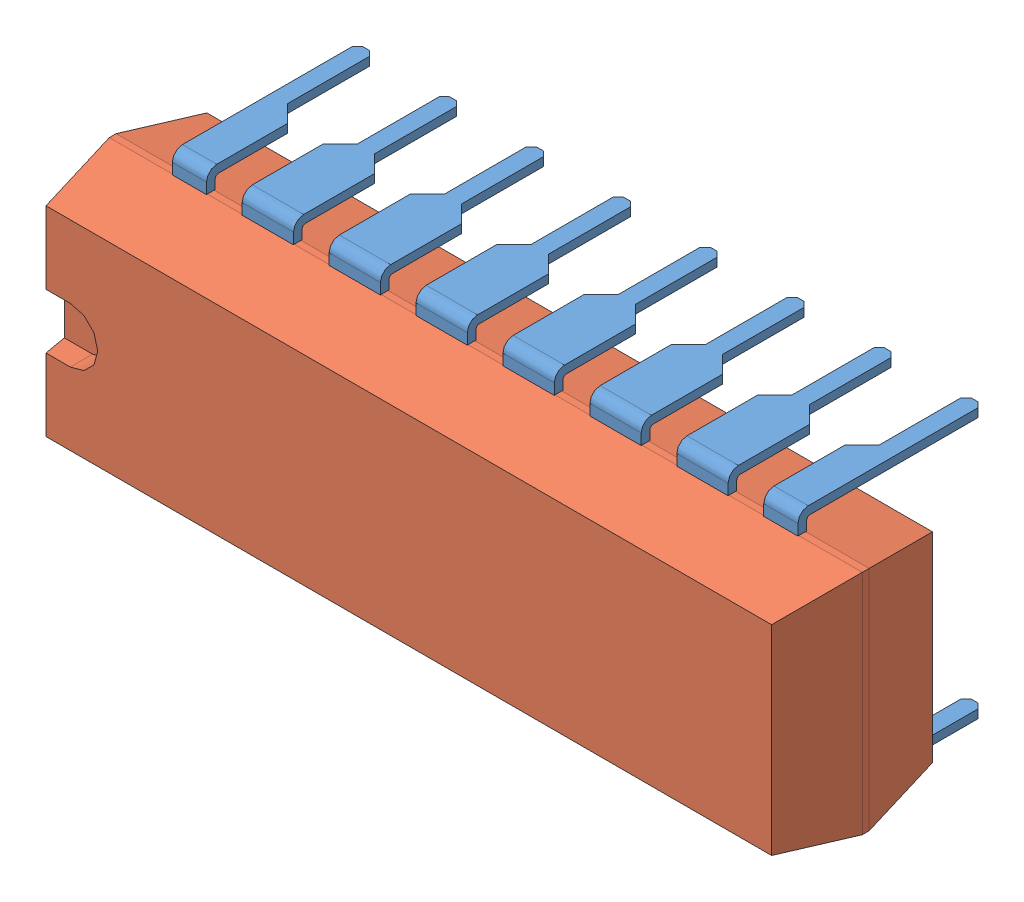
SolidWorks assembly User Library-DIP16-22mm.sldasm, configuration Default (file format 9000). Lengths in mm.
Overall size (22 7.87 7.64).
2 component instances, 2 part files, 0 mates.
Components (placement in the parent):
- User Library-DIP16-22mm_DIP16_22mm-1: User Library-DIP16-22mm_DIP16_22mm.sldprt [Default] at origin size (20 7.87 7.57)
- User Library-DIP16-22mm_DIP16_22mm001-1: User Library-DIP16-22mm_DIP16_22mm001.sldprt [Default] at origin size (22 6.64 4.7)
